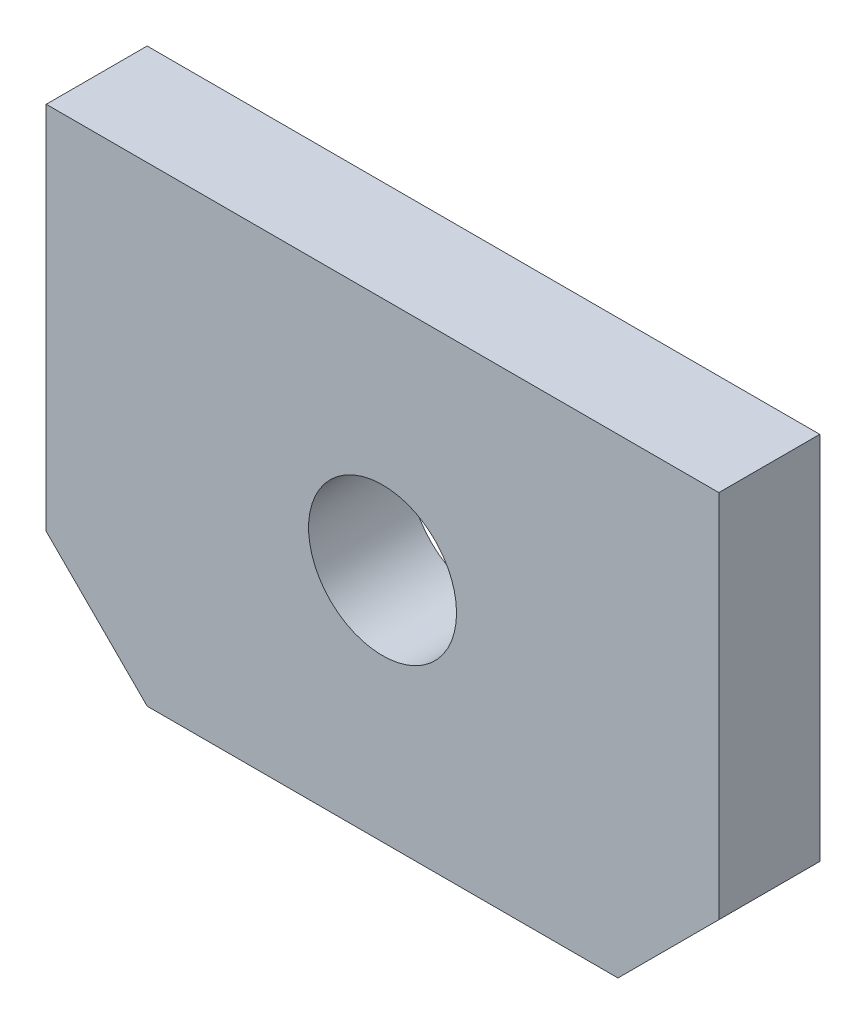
from build123d import *

# Parameters (mm, degrees)
ESQUISSE2_R      = 1.1
EXTRUSION1_DEPTH = 1.5


with BuildPart() as part:
    # Esquisse2 → Extrusion1 (new body)
    with BuildSketch(Plane.XY):
        Polygon((-20.450927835, -8.005360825), (-18.950927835, -9.505360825), (-11.950927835, -9.505360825), (-10.450927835, -8.005360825), (-10.450927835, -2.505360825), (-20.450927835, -2.505360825), align=None)
        with Locations((-15.450927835, -6.005360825)):
            Circle(ESQUISSE2_R, mode=Mode.SUBTRACT)
    extrude(amount=EXTRUSION1_DEPTH)


solid = part.part
